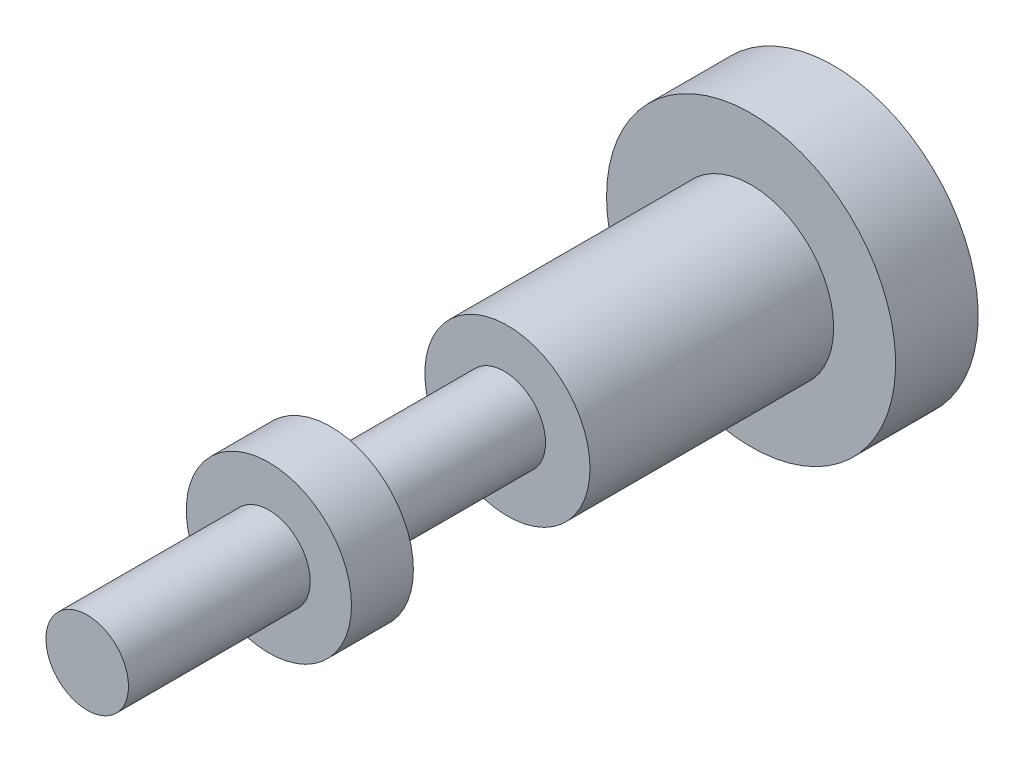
from build123d import *

# Parameters (mm, degrees)
SKETCH_1_R          = 2
EXTRUDE_1_DEPTH     = 32
SKETCH_2_R          = 7
EXTRUDE_2_DEPTH     = 4
EXTRUDE_START       = -23.2
SKETCH_3_R          = 4
SKETCH_3_R_2        = 2
EXTRUDE_3_DEPTH     = 23.2
CUT_EXTRUDE_START   = -20.2
SKETCH_4_R          = 4
SKETCH_4_R_2        = 2
CUT_EXTRUDE_1_DEPTH = 20.2
EXTRUDE_START_2     = -11.8
SKETCH_6_R          = 4
SKETCH_6_R_2        = 2
EXTRUDE_4_DEPTH     = 11.8
CUT_EXTRUDE_START_2 = -8.8
SKETCH_7_R          = 4
SKETCH_7_R_2        = 2
CUT_EXTRUDE_2_DEPTH = 8.8
EXTRUDE_START_3     = 8.8
SKETCH_8_R          = 4
SKETCH_8_R_2        = 2
EXTRUDE_5_DEPTH     = 8.8


with BuildPart() as part:
    # Sketch 1 → Extrude 1 (new body)
    with BuildSketch(Plane.XY):
        with Locations((-20.028176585, 4.797777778)):
            Circle(SKETCH_1_R)
    extrude(amount=EXTRUDE_1_DEPTH)

    # Sketch 2 → Extrude 2 (add)
    with BuildSketch(Plane(origin=(0, 0, 0), x_dir=(-1, 0, 0), z_dir=(0, 0, -1))):
        with Locations((20.028176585, 4.797777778)):
            Circle(SKETCH_2_R)
    extrude(amount=EXTRUDE_2_DEPTH)

    # Sketch 3 → Extrude 3 (add)
    with BuildSketch(Plane.XY.offset(32).offset(EXTRUDE_START)):
        with Locations((-20.028176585, 4.797777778)):
            Circle(SKETCH_3_R)
        with Locations(Location((-20.028176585, 4.797777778, 0), (0, 0, 180))):
            Circle(SKETCH_3_R_2, mode=Mode.SUBTRACT)
    extrude(amount=EXTRUDE_3_DEPTH)

    # Sketch 4 → Cut-Extrude 1 (cut)
    with BuildSketch(Plane.XY.offset(32).offset(CUT_EXTRUDE_START)):
        with Locations((-20.028176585, 4.797777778)):
            Circle(SKETCH_4_R)
        with Locations((-20.183284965, 4.797777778)):
            Circle(SKETCH_4_R_2, mode=Mode.SUBTRACT)
    extrude(amount=CUT_EXTRUDE_1_DEPTH, mode=Mode.SUBTRACT)

    # Sketch 6 → Extrude 4 (add)
    with BuildSketch(Plane.XY.offset(32).offset(EXTRUDE_START_2)):
        with Locations((-20.183284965, 4.676309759)):
            Circle(SKETCH_6_R)
        with Locations((-20.183284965, 4.797777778)):
            Circle(SKETCH_6_R_2, mode=Mode.SUBTRACT)
    extrude(amount=EXTRUDE_4_DEPTH)

    # Sketch 7 → Cut-Extrude 2 (cut)
    with BuildSketch(Plane.XY.offset(32).offset(CUT_EXTRUDE_START_2)):
        with Locations((-20.183284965, 4.676309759)):
            Circle(SKETCH_7_R)
        with Locations((-20.183284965, 4.676309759)):
            Circle(SKETCH_7_R_2, mode=Mode.SUBTRACT)
    extrude(amount=CUT_EXTRUDE_2_DEPTH, mode=Mode.SUBTRACT)

    # Sketch 8 → Extrude 5 (add)
    with BuildSketch(Plane(origin=(0, 0, 8.8), x_dir=(-1, 0, 0), z_dir=(0, 0, -1)).offset(EXTRUDE_START_3)):
        with Locations(Location((20.028176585, 4.797777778, 0), (0, 0, 180))):
            Circle(SKETCH_8_R)
        with Locations((20.028176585, 4.797777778)):
            Circle(SKETCH_8_R_2, mode=Mode.SUBTRACT)
    extrude(amount=-EXTRUDE_5_DEPTH)


solid = part.part
